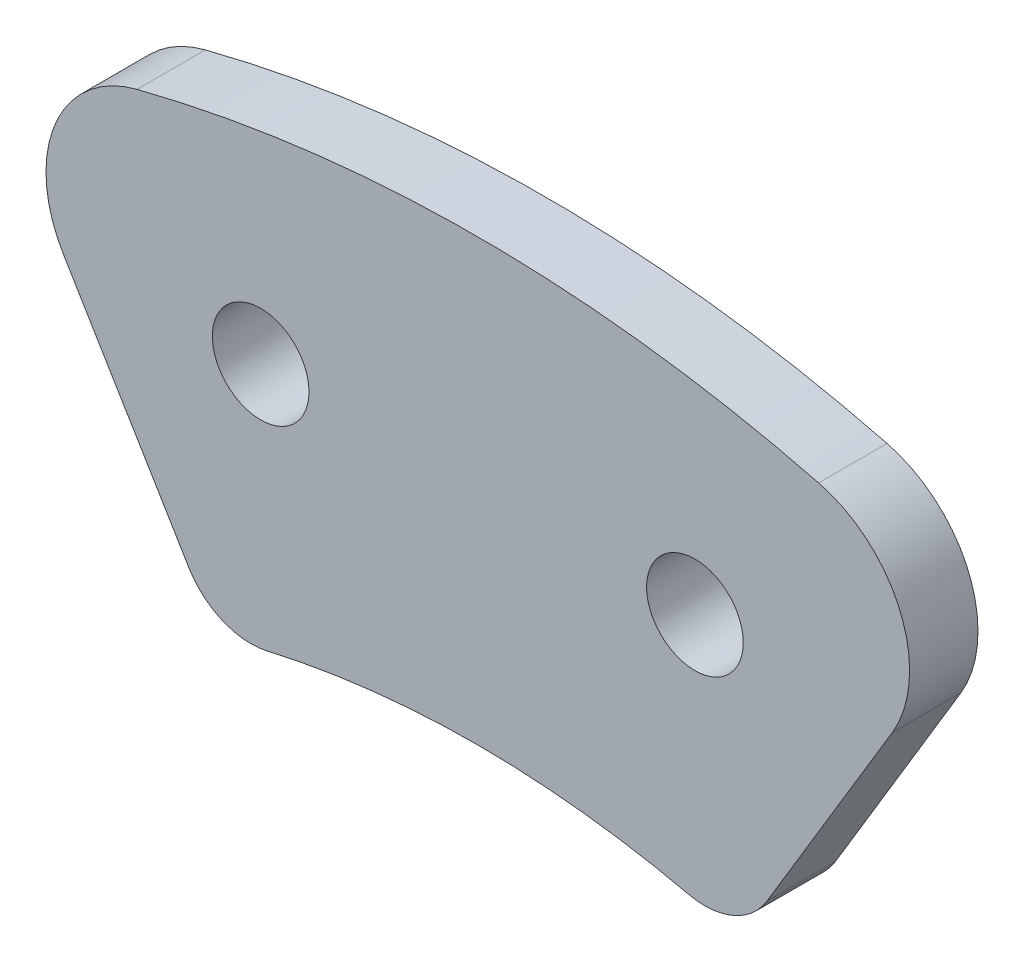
ISO-10303-21;
HEADER;
FILE_DESCRIPTION(('STEP AP214'),'2;1');
FILE_NAME('part.step','',(''),(''),'','','');
FILE_SCHEMA(('AUTOMOTIVE_DESIGN { 1 0 10303 214 1 1 1 1 }'));
ENDSEC;
DATA;
#1=APPLICATION_CONTEXT('core data for automotive mechanical design processes');
#2=APPLICATION_PROTOCOL_DEFINITION('international standard','automotive_design',2000,#1);
#3=PRODUCT_CONTEXT('',#1,'mechanical');
#4=PRODUCT('Part','Part','',(#3));
#5=PRODUCT_RELATED_PRODUCT_CATEGORY('part','',(#4));
#6=PRODUCT_DEFINITION_FORMATION('','',#4);
#7=PRODUCT_DEFINITION_CONTEXT('part definition',#1,'design');
#8=PRODUCT_DEFINITION('design','',#6,#7);
#9=PRODUCT_DEFINITION_SHAPE('','',#8);
#10=(LENGTH_UNIT() NAMED_UNIT(*) SI_UNIT(.MILLI.,.METRE.));
#11=(NAMED_UNIT(*) PLANE_ANGLE_UNIT() SI_UNIT($,.RADIAN.));
#12=(NAMED_UNIT(*) SI_UNIT($,.STERADIAN.) SOLID_ANGLE_UNIT());
#13=UNCERTAINTY_MEASURE_WITH_UNIT(LENGTH_MEASURE(1.E-05),#10,'distance_accuracy_value','');
#14=(GEOMETRIC_REPRESENTATION_CONTEXT(3) GLOBAL_UNCERTAINTY_ASSIGNED_CONTEXT((#13)) GLOBAL_UNIT_ASSIGNED_CONTEXT((#10,
#11,#12)) REPRESENTATION_CONTEXT('',''));
#15=CARTESIAN_POINT('',(0.,0.,0.));
#16=DIRECTION('',(0.,0.,1.));
#17=DIRECTION('',(1.,0.,0.));
#18=AXIS2_PLACEMENT_3D('',#15,#16,#17);
#19=CARTESIAN_POINT('',(0.,0.,0.75));
#20=DIRECTION('',(0.,0.,1.));
#21=DIRECTION('',(1.,0.,0.));
#22=AXIS2_PLACEMENT_3D('',#19,#20,#21);
#23=PLANE('',#22);
#24=CARTESIAN_POINT('',(-4.76250000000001,25.4771247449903,0.75));
#25=DIRECTION('',(0.,0.,1.));
#26=DIRECTION('',(1.,0.,0.));
#27=AXIS2_PLACEMENT_3D('',#24,#25,#26);
#28=CIRCLE('',#27,1.06);
#29=CARTESIAN_POINT('',(-3.70250000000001,25.4771247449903,0.75));
#30=VERTEX_POINT('',#29);
#31=EDGE_CURVE('E176',#30,#30,#28,.T.);
#32=ORIENTED_EDGE('',*,*,#31,.F.);
#33=EDGE_LOOP('',(#32));
#34=FACE_BOUND('',#33,.T.);
#35=DIRECTION('',(0.515038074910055,-0.857167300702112,0.));
#36=VECTOR('',#35,1.);
#37=CARTESIAN_POINT('',(-5.73072103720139,19.8109311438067,0.75));
#38=LINE('',#37,#36);
#39=CARTESIAN_POINT('',(-9.09308728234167,25.4068482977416,0.75));
#40=VERTEX_POINT('',#39);
#41=CARTESIAN_POINT('',(-6.34238958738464,20.8289185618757,0.75));
#42=VERTEX_POINT('',#41);
#43=EDGE_CURVE('E135',#40,#42,#38,.T.);
#44=ORIENTED_EDGE('',*,*,#43,.T.);
#45=CARTESIAN_POINT('',(-4.97949357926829,21.6478291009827,0.75));
#46=DIRECTION('',(0.,0.,1.));
#47=DIRECTION('',(1.,0.,0.));
#48=AXIS2_PLACEMENT_3D('',#45,#46,#47);
#49=CIRCLE('',#48,1.59);
#50=CARTESIAN_POINT('',(-4.62306523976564,20.0982940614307,0.75));
#51=VERTEX_POINT('',#50);
#52=EDGE_CURVE('E39',#42,#51,#49,.T.);
#53=ORIENTED_EDGE('',*,*,#52,.T.);
#54=CARTESIAN_POINT('',(0.,0.,0.75));
#55=DIRECTION('',(0.,0.,-1.));
#56=DIRECTION('',(1.,0.,0.));
#57=AXIS2_PLACEMENT_3D('',#54,#55,#56);
#58=CIRCLE('',#57,20.6231461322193);
#59=CARTESIAN_POINT('',(4.62306523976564,20.0982940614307,0.75));
#60=VERTEX_POINT('',#59);
#61=EDGE_CURVE('E129',#51,#60,#58,.T.);
#62=ORIENTED_EDGE('',*,*,#61,.T.);
#63=CARTESIAN_POINT('',(4.97949357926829,21.6478291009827,0.75));
#64=DIRECTION('',(0.,0.,1.));
#65=DIRECTION('',(1.,0.,0.));
#66=AXIS2_PLACEMENT_3D('',#63,#64,#65);
#67=CIRCLE('',#66,1.59);
#68=CARTESIAN_POINT('',(6.34238958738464,20.8289185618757,0.75));
#69=VERTEX_POINT('',#68);
#70=EDGE_CURVE('E46',#60,#69,#67,.T.);
#71=ORIENTED_EDGE('',*,*,#70,.T.);
#72=DIRECTION('',(0.515038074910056,0.857167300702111,0.));
#73=VECTOR('',#72,1.);
#74=CARTESIAN_POINT('',(5.73072103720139,19.8109311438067,0.75));
#75=LINE('',#74,#73);
#76=CARTESIAN_POINT('',(9.09308728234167,25.4068482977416,0.75));
#77=VERTEX_POINT('',#76);
#78=EDGE_CURVE('E165',#69,#77,#75,.T.);
#79=ORIENTED_EDGE('',*,*,#78,.T.);
#80=CARTESIAN_POINT('',(6.82159393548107,26.7716991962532,0.75));
#81=DIRECTION('',(0.,0.,1.));
#82=DIRECTION('',(1.,0.,0.));
#83=AXIS2_PLACEMENT_3D('',#80,#81,#82);
#84=CIRCLE('',#83,2.65);
#85=CARTESIAN_POINT('',(7.47592275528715,29.3396465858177,0.75));
#86=VERTEX_POINT('',#85);
#87=EDGE_CURVE('E141',#77,#86,#84,.T.);
#88=ORIENTED_EDGE('',*,*,#87,.T.);
#89=CARTESIAN_POINT('',(0.,0.,0.75));
#90=DIRECTION('',(0.,0.,1.));
#91=DIRECTION('',(1.,0.,0.));
#92=AXIS2_PLACEMENT_3D('',#89,#90,#91);
#93=CIRCLE('',#92,30.2771247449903);
#94=CARTESIAN_POINT('',(-7.47592275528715,29.3396465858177,0.75));
#95=VERTEX_POINT('',#94);
#96=EDGE_CURVE('E119',#86,#95,#93,.T.);
#97=ORIENTED_EDGE('',*,*,#96,.T.);
#98=CARTESIAN_POINT('',(-6.82159393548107,26.7716991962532,0.75));
#99=DIRECTION('',(0.,0.,1.));
#100=DIRECTION('',(1.,0.,0.));
#101=AXIS2_PLACEMENT_3D('',#98,#99,#100);
#102=CIRCLE('',#101,2.65);
#103=EDGE_CURVE('E139',#95,#40,#102,.T.);
#104=ORIENTED_EDGE('',*,*,#103,.T.);
#105=EDGE_LOOP('',(#44,#53,#62,#71,#79,#88,#97,#104));
#106=FACE_BOUND('',#105,.T.);
#107=CARTESIAN_POINT('',(4.76250000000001,25.4771247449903,0.75));
#108=DIRECTION('',(0.,0.,1.));
#109=DIRECTION('',(1.,0.,0.));
#110=AXIS2_PLACEMENT_3D('',#107,#108,#109);
#111=CIRCLE('',#110,1.06);
#112=CARTESIAN_POINT('',(5.82250000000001,25.4771247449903,0.75));
#113=VERTEX_POINT('',#112);
#114=EDGE_CURVE('E183',#113,#113,#111,.T.);
#115=ORIENTED_EDGE('',*,*,#114,.F.);
#116=EDGE_LOOP('',(#115));
#117=FACE_BOUND('',#116,.T.);
#118=ADVANCED_FACE('F31',(#34,#106,#117),#23,.T.);
#119=CARTESIAN_POINT('',(0.,0.,-0.75));
#120=DIRECTION('',(0.,0.,1.));
#121=DIRECTION('',(1.,0.,0.));
#122=AXIS2_PLACEMENT_3D('',#119,#120,#121);
#123=PLANE('',#122);
#124=CARTESIAN_POINT('',(-4.76250000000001,25.4771247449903,-0.75));
#125=DIRECTION('',(0.,0.,1.));
#126=DIRECTION('',(1.,0.,0.));
#127=AXIS2_PLACEMENT_3D('',#124,#125,#126);
#128=CIRCLE('',#127,1.06);
#129=CARTESIAN_POINT('',(-3.70250000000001,25.4771247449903,-0.75));
#130=VERTEX_POINT('',#129);
#131=EDGE_CURVE('E178',#130,#130,#128,.T.);
#132=ORIENTED_EDGE('',*,*,#131,.T.);
#133=EDGE_LOOP('',(#132));
#134=FACE_BOUND('',#133,.T.);
#135=CARTESIAN_POINT('',(0.,0.,-0.75));
#136=DIRECTION('',(0.,0.,-1.));
#137=DIRECTION('',(1.,0.,0.));
#138=AXIS2_PLACEMENT_3D('',#135,#136,#137);
#139=CIRCLE('',#138,20.6231461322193);
#140=CARTESIAN_POINT('',(-4.62306523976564,20.0982940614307,-0.75));
#141=VERTEX_POINT('',#140);
#142=CARTESIAN_POINT('',(4.62306523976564,20.0982940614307,-0.75));
#143=VERTEX_POINT('',#142);
#144=EDGE_CURVE('E131',#141,#143,#139,.T.);
#145=ORIENTED_EDGE('',*,*,#144,.F.);
#146=CARTESIAN_POINT('',(-4.97949357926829,21.6478291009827,-0.75));
#147=DIRECTION('',(0.,0.,1.));
#148=DIRECTION('',(1.,0.,0.));
#149=AXIS2_PLACEMENT_3D('',#146,#147,#148);
#150=CIRCLE('',#149,1.59);
#151=CARTESIAN_POINT('',(-6.34238958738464,20.8289185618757,-0.75));
#152=VERTEX_POINT('',#151);
#153=EDGE_CURVE('E153',#141,#152,#150,.F.);
#154=ORIENTED_EDGE('',*,*,#153,.T.);
#155=DIRECTION('',(0.515038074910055,-0.857167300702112,0.));
#156=VECTOR('',#155,1.);
#157=CARTESIAN_POINT('',(-5.73072103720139,19.8109311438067,-0.75));
#158=LINE('',#157,#156);
#159=CARTESIAN_POINT('',(-9.09308728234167,25.4068482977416,-0.75));
#160=VERTEX_POINT('',#159);
#161=EDGE_CURVE('E126',#160,#152,#158,.T.);
#162=ORIENTED_EDGE('',*,*,#161,.F.);
#163=CARTESIAN_POINT('',(-6.82159393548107,26.7716991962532,-0.75));
#164=DIRECTION('',(0.,0.,1.));
#165=DIRECTION('',(1.,0.,0.));
#166=AXIS2_PLACEMENT_3D('',#163,#164,#165);
#167=CIRCLE('',#166,2.65);
#168=CARTESIAN_POINT('',(-7.47592275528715,29.3396465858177,-0.75));
#169=VERTEX_POINT('',#168);
#170=EDGE_CURVE('E110',#160,#169,#167,.F.);
#171=ORIENTED_EDGE('',*,*,#170,.T.);
#172=CARTESIAN_POINT('',(0.,0.,-0.75));
#173=DIRECTION('',(0.,0.,1.));
#174=DIRECTION('',(1.,0.,0.));
#175=AXIS2_PLACEMENT_3D('',#172,#173,#174);
#176=CIRCLE('',#175,30.2771247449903);
#177=CARTESIAN_POINT('',(7.47592275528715,29.3396465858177,-0.75));
#178=VERTEX_POINT('',#177);
#179=EDGE_CURVE('E116',#178,#169,#176,.T.);
#180=ORIENTED_EDGE('',*,*,#179,.F.);
#181=CARTESIAN_POINT('',(6.82159393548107,26.7716991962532,-0.75));
#182=DIRECTION('',(0.,0.,1.));
#183=DIRECTION('',(1.,0.,0.));
#184=AXIS2_PLACEMENT_3D('',#181,#182,#183);
#185=CIRCLE('',#184,2.65);
#186=CARTESIAN_POINT('',(9.09308728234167,25.4068482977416,-0.75));
#187=VERTEX_POINT('',#186);
#188=EDGE_CURVE('E100',#178,#187,#185,.F.);
#189=ORIENTED_EDGE('',*,*,#188,.T.);
#190=DIRECTION('',(0.515038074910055,0.857167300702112,0.));
#191=VECTOR('',#190,1.);
#192=CARTESIAN_POINT('',(8.3001417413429,24.087165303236,-0.75));
#193=LINE('',#192,#191);
#194=CARTESIAN_POINT('',(6.34238958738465,20.8289185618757,-0.75));
#195=VERTEX_POINT('',#194);
#196=EDGE_CURVE('E127',#195,#187,#193,.T.);
#197=ORIENTED_EDGE('',*,*,#196,.F.);
#198=CARTESIAN_POINT('',(4.97949357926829,21.6478291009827,-0.75));
#199=DIRECTION('',(0.,0.,1.));
#200=DIRECTION('',(1.,0.,0.));
#201=AXIS2_PLACEMENT_3D('',#198,#199,#200);
#202=CIRCLE('',#201,1.59);
#203=EDGE_CURVE('E151',#195,#143,#202,.F.);
#204=ORIENTED_EDGE('',*,*,#203,.T.);
#205=EDGE_LOOP('',(#145,#154,#162,#171,#180,#189,#197,#204));
#206=FACE_BOUND('',#205,.T.);
#207=CARTESIAN_POINT('',(4.76250000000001,25.4771247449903,-0.75));
#208=DIRECTION('',(0.,0.,1.));
#209=DIRECTION('',(1.,0.,0.));
#210=AXIS2_PLACEMENT_3D('',#207,#208,#209);
#211=CIRCLE('',#210,1.06);
#212=CARTESIAN_POINT('',(5.82250000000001,25.4771247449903,-0.75));
#213=VERTEX_POINT('',#212);
#214=EDGE_CURVE('E186',#213,#213,#211,.T.);
#215=ORIENTED_EDGE('',*,*,#214,.T.);
#216=EDGE_LOOP('',(#215));
#217=FACE_BOUND('',#216,.T.);
#218=ADVANCED_FACE('F123',(#134,#206,#217),#123,.F.);
#219=CARTESIAN_POINT('',(0.,0.,0.75));
#220=DIRECTION('',(0.,0.,-1.));
#221=DIRECTION('',(-1.,0.,0.));
#222=AXIS2_PLACEMENT_3D('',#219,#220,#221);
#223=CYLINDRICAL_SURFACE('',#222,20.6231461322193);
#224=ORIENTED_EDGE('',*,*,#61,.F.);
#225=DIRECTION('',(0.,0.,-1.));
#226=VECTOR('',#225,1.);
#227=CARTESIAN_POINT('',(-4.62306523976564,20.0982940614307,0.75));
#228=LINE('',#227,#226);
#229=EDGE_CURVE('E148',#51,#141,#228,.T.);
#230=ORIENTED_EDGE('',*,*,#229,.T.);
#231=ORIENTED_EDGE('',*,*,#144,.T.);
#232=DIRECTION('',(0.,0.,-1.));
#233=VECTOR('',#232,1.);
#234=CARTESIAN_POINT('',(4.62306523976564,20.0982940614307,0.75));
#235=LINE('',#234,#233);
#236=EDGE_CURVE('E146',#143,#60,#235,.F.);
#237=ORIENTED_EDGE('',*,*,#236,.T.);
#238=EDGE_LOOP('',(#224,#230,#231,#237));
#239=FACE_BOUND('',#238,.T.);
#240=ADVANCED_FACE('F162',(#239),#223,.F.);
#241=CARTESIAN_POINT('',(8.3001417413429,24.087165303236,0.75));
#242=DIRECTION('',(-0.857167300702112,0.515038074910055,0.));
#243=DIRECTION('',(-0.515038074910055,-0.857167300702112,0.));
#244=AXIS2_PLACEMENT_3D('',#241,#242,#243);
#245=PLANE('',#244);
#246=ORIENTED_EDGE('',*,*,#78,.F.);
#247=DIRECTION('',(0.,0.,-1.));
#248=VECTOR('',#247,1.);
#249=CARTESIAN_POINT('',(6.34238958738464,20.8289185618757,0.75));
#250=LINE('',#249,#248);
#251=EDGE_CURVE('E11',#69,#195,#250,.T.);
#252=ORIENTED_EDGE('',*,*,#251,.T.);
#253=ORIENTED_EDGE('',*,*,#196,.T.);
#254=DIRECTION('',(0.,0.,-1.));
#255=VECTOR('',#254,1.);
#256=CARTESIAN_POINT('',(9.09308728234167,25.4068482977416,0.75));
#257=LINE('',#256,#255);
#258=EDGE_CURVE('E106',#187,#77,#257,.F.);
#259=ORIENTED_EDGE('',*,*,#258,.T.);
#260=EDGE_LOOP('',(#246,#252,#253,#259));
#261=FACE_BOUND('',#260,.T.);
#262=ADVANCED_FACE('F210',(#261),#245,.F.);
#263=CARTESIAN_POINT('',(0.,0.,0.75));
#264=DIRECTION('',(0.,0.,-1.));
#265=DIRECTION('',(-1.,0.,0.));
#266=AXIS2_PLACEMENT_3D('',#263,#264,#265);
#267=CYLINDRICAL_SURFACE('',#266,30.2771247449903);
#268=ORIENTED_EDGE('',*,*,#96,.F.);
#269=DIRECTION('',(0.,0.,-1.));
#270=VECTOR('',#269,1.);
#271=CARTESIAN_POINT('',(7.47592275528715,29.3396465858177,0.75));
#272=LINE('',#271,#270);
#273=EDGE_CURVE('E104',#86,#178,#272,.T.);
#274=ORIENTED_EDGE('',*,*,#273,.T.);
#275=ORIENTED_EDGE('',*,*,#179,.T.);
#276=DIRECTION('',(0.,0.,-1.));
#277=VECTOR('',#276,1.);
#278=CARTESIAN_POINT('',(-7.47592275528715,29.3396465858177,0.75));
#279=LINE('',#278,#277);
#280=EDGE_CURVE('E120',#169,#95,#279,.F.);
#281=ORIENTED_EDGE('',*,*,#280,.T.);
#282=EDGE_LOOP('',(#268,#274,#275,#281));
#283=FACE_BOUND('',#282,.T.);
#284=ADVANCED_FACE('F115',(#283),#267,.T.);
#285=CARTESIAN_POINT('',(-5.73072103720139,19.8109311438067,0.75));
#286=DIRECTION('',(0.857167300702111,0.515038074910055,0.));
#287=DIRECTION('',(-0.515038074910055,0.857167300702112,0.));
#288=AXIS2_PLACEMENT_3D('',#285,#286,#287);
#289=PLANE('',#288);
#290=ORIENTED_EDGE('',*,*,#161,.T.);
#291=DIRECTION('',(0.,0.,-1.));
#292=VECTOR('',#291,1.);
#293=CARTESIAN_POINT('',(-6.34238958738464,20.8289185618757,0.75));
#294=LINE('',#293,#292);
#295=EDGE_CURVE('E54',#152,#42,#294,.F.);
#296=ORIENTED_EDGE('',*,*,#295,.T.);
#297=ORIENTED_EDGE('',*,*,#43,.F.);
#298=DIRECTION('',(0.,0.,-1.));
#299=VECTOR('',#298,1.);
#300=CARTESIAN_POINT('',(-9.09308728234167,25.4068482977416,0.75));
#301=LINE('',#300,#299);
#302=EDGE_CURVE('E143',#40,#160,#301,.T.);
#303=ORIENTED_EDGE('',*,*,#302,.T.);
#304=EDGE_LOOP('',(#290,#296,#297,#303));
#305=FACE_BOUND('',#304,.T.);
#306=ADVANCED_FACE('F168',(#305),#289,.F.);
#307=CARTESIAN_POINT('',(-4.76250000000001,25.4771247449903,0.75));
#308=DIRECTION('',(0.,0.,-1.));
#309=DIRECTION('',(-1.,0.,0.));
#310=AXIS2_PLACEMENT_3D('',#307,#308,#309);
#311=CYLINDRICAL_SURFACE('',#310,1.06);
#312=ORIENTED_EDGE('',*,*,#31,.T.);
#313=EDGE_LOOP('',(#312));
#314=FACE_BOUND('',#313,.T.);
#315=ORIENTED_EDGE('',*,*,#131,.F.);
#316=EDGE_LOOP('',(#315));
#317=FACE_BOUND('',#316,.T.);
#318=ADVANCED_FACE('F203',(#314,#317),#311,.F.);
#319=CARTESIAN_POINT('',(4.76250000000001,25.4771247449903,0.75));
#320=DIRECTION('',(0.,0.,-1.));
#321=DIRECTION('',(-1.,0.,0.));
#322=AXIS2_PLACEMENT_3D('',#319,#320,#321);
#323=CYLINDRICAL_SURFACE('',#322,1.06);
#324=ORIENTED_EDGE('',*,*,#114,.T.);
#325=EDGE_LOOP('',(#324));
#326=FACE_BOUND('',#325,.T.);
#327=ORIENTED_EDGE('',*,*,#214,.F.);
#328=EDGE_LOOP('',(#327));
#329=FACE_BOUND('',#328,.T.);
#330=ADVANCED_FACE('F192',(#326,#329),#323,.F.);
#331=CARTESIAN_POINT('',(6.82159393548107,26.7716991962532,0.75));
#332=DIRECTION('',(0.,0.,-1.));
#333=DIRECTION('',(-1.,0.,0.));
#334=AXIS2_PLACEMENT_3D('',#331,#332,#333);
#335=CYLINDRICAL_SURFACE('',#334,2.65);
#336=ORIENTED_EDGE('',*,*,#87,.F.);
#337=ORIENTED_EDGE('',*,*,#258,.F.);
#338=ORIENTED_EDGE('',*,*,#188,.F.);
#339=ORIENTED_EDGE('',*,*,#273,.F.);
#340=EDGE_LOOP('',(#336,#337,#338,#339));
#341=FACE_BOUND('',#340,.T.);
#342=ADVANCED_FACE('F103',(#341),#335,.T.);
#343=CARTESIAN_POINT('',(-6.82159393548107,26.7716991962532,0.75));
#344=DIRECTION('',(0.,0.,-1.));
#345=DIRECTION('',(-1.,0.,0.));
#346=AXIS2_PLACEMENT_3D('',#343,#344,#345);
#347=CYLINDRICAL_SURFACE('',#346,2.65);
#348=ORIENTED_EDGE('',*,*,#103,.F.);
#349=ORIENTED_EDGE('',*,*,#280,.F.);
#350=ORIENTED_EDGE('',*,*,#170,.F.);
#351=ORIENTED_EDGE('',*,*,#302,.F.);
#352=EDGE_LOOP('',(#348,#349,#350,#351));
#353=FACE_BOUND('',#352,.T.);
#354=ADVANCED_FACE('F172',(#353),#347,.T.);
#355=CARTESIAN_POINT('',(-4.97949357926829,21.6478291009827,0.75));
#356=DIRECTION('',(0.,0.,-1.));
#357=DIRECTION('',(-1.,0.,0.));
#358=AXIS2_PLACEMENT_3D('',#355,#356,#357);
#359=CYLINDRICAL_SURFACE('',#358,1.59);
#360=ORIENTED_EDGE('',*,*,#52,.F.);
#361=ORIENTED_EDGE('',*,*,#295,.F.);
#362=ORIENTED_EDGE('',*,*,#153,.F.);
#363=ORIENTED_EDGE('',*,*,#229,.F.);
#364=EDGE_LOOP('',(#360,#361,#362,#363));
#365=FACE_BOUND('',#364,.T.);
#366=ADVANCED_FACE('F167',(#365),#359,.T.);
#367=CARTESIAN_POINT('',(4.97949357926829,21.6478291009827,0.75));
#368=DIRECTION('',(0.,0.,-1.));
#369=DIRECTION('',(-1.,0.,0.));
#370=AXIS2_PLACEMENT_3D('',#367,#368,#369);
#371=CYLINDRICAL_SURFACE('',#370,1.59);
#372=ORIENTED_EDGE('',*,*,#70,.F.);
#373=ORIENTED_EDGE('',*,*,#236,.F.);
#374=ORIENTED_EDGE('',*,*,#203,.F.);
#375=ORIENTED_EDGE('',*,*,#251,.F.);
#376=EDGE_LOOP('',(#372,#373,#374,#375));
#377=FACE_BOUND('',#376,.T.);
#378=ADVANCED_FACE('F33',(#377),#371,.T.);
#379=CLOSED_SHELL('',(#118,#218,#240,#262,#284,#306,#318,#330,#342,#354,#366,#378));
#380=MANIFOLD_SOLID_BREP('B2',#379);
#381=ADVANCED_BREP_SHAPE_REPRESENTATION('',(#18,#380),#14);
#382=SHAPE_DEFINITION_REPRESENTATION(#9,#381);
ENDSEC;
END-ISO-10303-21;
